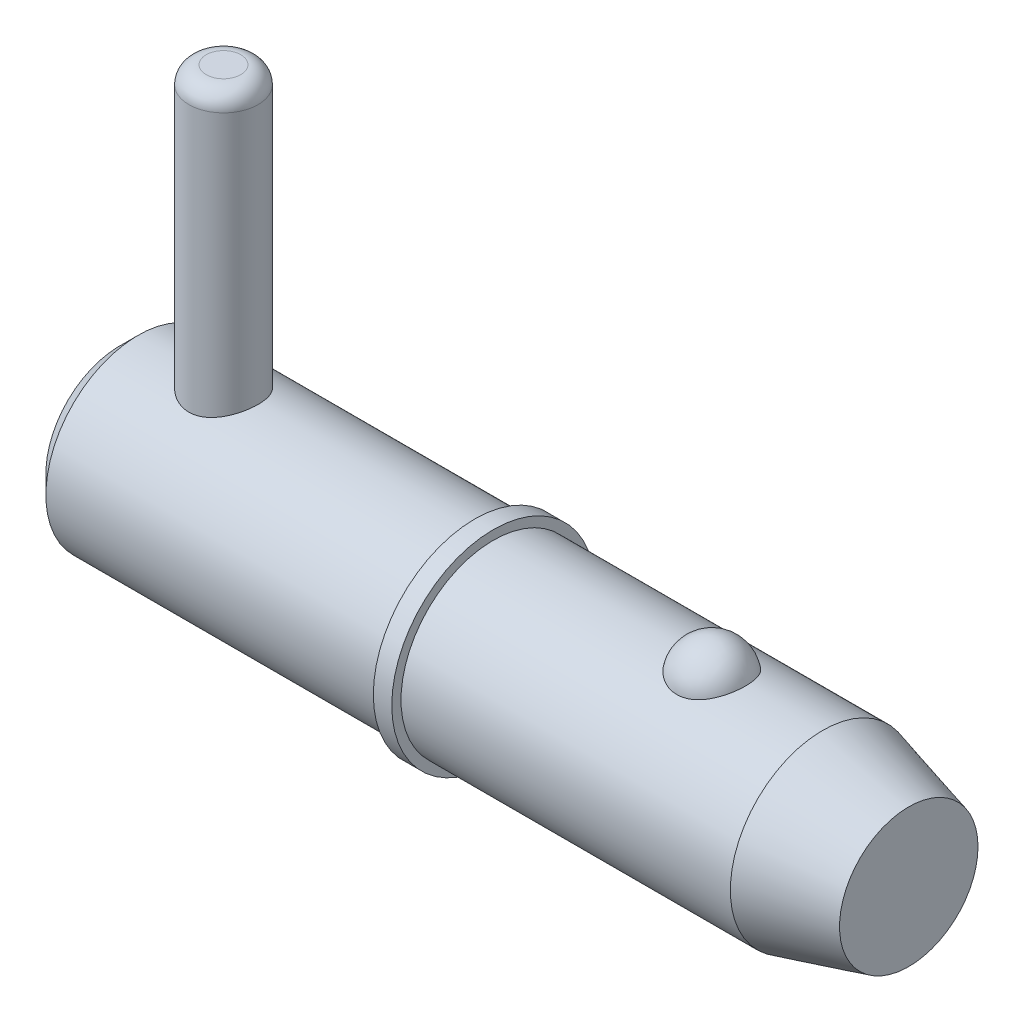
ISO-10303-21;
HEADER;
FILE_DESCRIPTION(('STEP AP214'),'2;1');
FILE_NAME('part.step','',(''),(''),'','','');
FILE_SCHEMA(('AUTOMOTIVE_DESIGN { 1 0 10303 214 1 1 1 1 }'));
ENDSEC;
DATA;
#1=APPLICATION_CONTEXT('core data for automotive mechanical design processes');
#2=APPLICATION_PROTOCOL_DEFINITION('international standard','automotive_design',2000,#1);
#3=PRODUCT_CONTEXT('',#1,'mechanical');
#4=PRODUCT('Part','Part','',(#3));
#5=PRODUCT_RELATED_PRODUCT_CATEGORY('part','',(#4));
#6=PRODUCT_DEFINITION_FORMATION('','',#4);
#7=PRODUCT_DEFINITION_CONTEXT('part definition',#1,'design');
#8=PRODUCT_DEFINITION('design','',#6,#7);
#9=PRODUCT_DEFINITION_SHAPE('','',#8);
#10=(LENGTH_UNIT() NAMED_UNIT(*) SI_UNIT(.MILLI.,.METRE.));
#11=(NAMED_UNIT(*) PLANE_ANGLE_UNIT() SI_UNIT($,.RADIAN.));
#12=(NAMED_UNIT(*) SI_UNIT($,.STERADIAN.) SOLID_ANGLE_UNIT());
#13=UNCERTAINTY_MEASURE_WITH_UNIT(LENGTH_MEASURE(1.E-05),#10,'distance_accuracy_value','');
#14=(GEOMETRIC_REPRESENTATION_CONTEXT(3) GLOBAL_UNCERTAINTY_ASSIGNED_CONTEXT((#13)) GLOBAL_UNIT_ASSIGNED_CONTEXT((#10,
#11,#12)) REPRESENTATION_CONTEXT('',''));
#15=CARTESIAN_POINT('',(0.,0.,0.));
#16=DIRECTION('',(0.,0.,1.));
#17=DIRECTION('',(1.,0.,0.));
#18=AXIS2_PLACEMENT_3D('',#15,#16,#17);
#19=CARTESIAN_POINT('',(7.14,25.4,0.));
#20=DIRECTION('',(0.,-1.,0.));
#21=DIRECTION('',(0.,0.,-1.));
#22=AXIS2_PLACEMENT_3D('',#19,#20,#21);
#23=CYLINDRICAL_SURFACE('',#22,2.38);
#24=CARTESIAN_POINT('',(7.14,-5.16,0.));
#25=DIRECTION('',(0.,1.,0.));
#26=DIRECTION('',(0.,0.,1.));
#27=AXIS2_PLACEMENT_3D('',#24,#25,#26);
#28=CIRCLE('',#27,2.38);
#29=CARTESIAN_POINT('',(7.14,-5.16,2.38));
#30=VERTEX_POINT('',#29);
#31=EDGE_CURVE('P0_E25',#30,#30,#28,.T.);
#32=ORIENTED_EDGE('',*,*,#31,.T.);
#33=EDGE_LOOP('',(#32));
#34=FACE_BOUND('',#33,.T.);
#35=CARTESIAN_POINT('',(7.14,24.21,0.));
#36=DIRECTION('',(0.,1.,0.));
#37=DIRECTION('',(0.,0.,1.));
#38=AXIS2_PLACEMENT_3D('',#35,#36,#37);
#39=CIRCLE('',#38,2.38);
#40=CARTESIAN_POINT('',(7.14,24.21,2.38));
#41=VERTEX_POINT('',#40);
#42=EDGE_CURVE('P0_E29',#41,#41,#39,.F.);
#43=ORIENTED_EDGE('',*,*,#42,.T.);
#44=EDGE_LOOP('',(#43));
#45=FACE_BOUND('',#44,.T.);
#46=ADVANCED_FACE('P0_F14',(#34,#45),#23,.T.);
#47=CARTESIAN_POINT('',(7.14,25.4,0.));
#48=DIRECTION('',(0.,1.,0.));
#49=DIRECTION('',(0.,0.,1.));
#50=AXIS2_PLACEMENT_3D('',#47,#48,#49);
#51=PLANE('',#50);
#52=CARTESIAN_POINT('',(7.14,25.4,0.));
#53=DIRECTION('',(0.,1.,0.));
#54=DIRECTION('',(0.,0.,1.));
#55=AXIS2_PLACEMENT_3D('',#52,#53,#54);
#56=CIRCLE('',#55,1.19);
#57=CARTESIAN_POINT('',(7.14,25.4,1.19));
#58=VERTEX_POINT('',#57);
#59=EDGE_CURVE('P0_E10',#58,#58,#56,.T.);
#60=ORIENTED_EDGE('',*,*,#59,.T.);
#61=EDGE_LOOP('',(#60));
#62=FACE_BOUND('',#61,.T.);
#63=ADVANCED_FACE('P0_F46',(#62),#51,.T.);
#64=CARTESIAN_POINT('',(7.14,-6.35,0.));
#65=DIRECTION('',(0.,1.,0.));
#66=DIRECTION('',(0.,0.,1.));
#67=AXIS2_PLACEMENT_3D('',#64,#65,#66);
#68=PLANE('',#67);
#69=CARTESIAN_POINT('',(7.14,-6.35,0.));
#70=DIRECTION('',(0.,1.,0.));
#71=DIRECTION('',(0.,0.,1.));
#72=AXIS2_PLACEMENT_3D('',#69,#70,#71);
#73=CIRCLE('',#72,1.19);
#74=CARTESIAN_POINT('',(7.14,-6.35,1.19));
#75=VERTEX_POINT('',#74);
#76=EDGE_CURVE('P0_E21',#75,#75,#73,.F.);
#77=ORIENTED_EDGE('',*,*,#76,.T.);
#78=EDGE_LOOP('',(#77));
#79=FACE_BOUND('',#78,.T.);
#80=ADVANCED_FACE('P0_F43',(#79),#68,.F.);
#81=CARTESIAN_POINT('',(7.14,-5.16,0.));
#82=DIRECTION('',(0.,1.,0.));
#83=DIRECTION('',(0.,0.,1.));
#84=AXIS2_PLACEMENT_3D('',#81,#82,#83);
#85=DEGENERATE_TOROIDAL_SURFACE('',#84,1.19,1.19,.T.);
#86=ORIENTED_EDGE('',*,*,#76,.F.);
#87=EDGE_LOOP('',(#86));
#88=FACE_BOUND('',#87,.T.);
#89=ORIENTED_EDGE('',*,*,#31,.F.);
#90=EDGE_LOOP('',(#89));
#91=FACE_BOUND('',#90,.T.);
#92=ADVANCED_FACE('P0_F38',(#88,#91),#85,.T.);
#93=CARTESIAN_POINT('',(7.14,24.21,0.));
#94=DIRECTION('',(0.,1.,0.));
#95=DIRECTION('',(0.,0.,1.));
#96=AXIS2_PLACEMENT_3D('',#93,#94,#95);
#97=DEGENERATE_TOROIDAL_SURFACE('',#96,1.19,1.19,.T.);
#98=ORIENTED_EDGE('',*,*,#42,.F.);
#99=EDGE_LOOP('',(#98));
#100=FACE_BOUND('',#99,.T.);
#101=ORIENTED_EDGE('',*,*,#59,.F.);
#102=EDGE_LOOP('',(#101));
#103=FACE_BOUND('',#102,.T.);
#104=ADVANCED_FACE('P0_F16',(#100,#103),#97,.T.);
#105=CLOSED_SHELL('',(#46,#63,#80,#92,#104));
#106=MANIFOLD_SOLID_BREP('P0_B1',#105);
#107=CARTESIAN_POINT('',(0.,0.,0.));
#108=DIRECTION('',(1.,0.,0.));
#109=DIRECTION('',(0.,0.,-1.));
#110=AXIS2_PLACEMENT_3D('',#107,#108,#109);
#111=CYLINDRICAL_SURFACE('',#110,6.35);
#112=CARTESIAN_POINT('',(48.3553693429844,0.,0.));
#113=DIRECTION('',(1.,0.,0.));
#114=DIRECTION('',(0.,0.,-1.));
#115=AXIS2_PLACEMENT_3D('',#112,#113,#114);
#116=CIRCLE('',#115,6.35);
#117=CARTESIAN_POINT('',(48.3553693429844,0.,-6.35));
#118=VERTEX_POINT('',#117);
#119=EDGE_CURVE('P1_E81',#118,#118,#116,.T.);
#120=ORIENTED_EDGE('',*,*,#119,.F.);
#121=EDGE_LOOP('',(#120));
#122=FACE_BOUND('',#121,.T.);
#123=CARTESIAN_POINT('',(25.7,0.,0.));
#124=DIRECTION('',(1.,0.,0.));
#125=DIRECTION('',(0.,0.,-1.));
#126=AXIS2_PLACEMENT_3D('',#123,#124,#125);
#127=CIRCLE('',#126,6.35);
#128=CARTESIAN_POINT('',(25.7,0.,-6.35));
#129=VERTEX_POINT('',#128);
#130=EDGE_CURVE('P1_E85',#129,#129,#127,.T.);
#131=ORIENTED_EDGE('',*,*,#130,.T.);
#132=EDGE_LOOP('',(#131));
#133=FACE_BOUND('',#132,.T.);
#134=CARTESIAN_POINT('',(40.7300214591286,5.87502187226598,2.40969251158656));
#135=CARTESIAN_POINT('',(40.6050305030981,5.87501645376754,2.40969773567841));
#136=CARTESIAN_POINT('',(40.4800806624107,5.87916061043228,2.39967292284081));
#137=CARTESIAN_POINT('',(40.2339091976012,5.89523112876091,2.35991730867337));
#138=CARTESIAN_POINT('',(40.1126863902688,5.90715499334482,2.33019283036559));
#139=CARTESIAN_POINT('',(39.8775170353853,5.9373956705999,2.25201402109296));
#140=CARTESIAN_POINT('',(39.7635602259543,5.95570321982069,2.20358681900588));
#141=CARTESIAN_POINT('',(39.54557352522,5.99672067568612,2.08937987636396));
#142=CARTESIAN_POINT('',(39.4415457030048,6.01943149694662,2.02359652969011));
#143=CARTESIAN_POINT('',(39.2429437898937,6.06760647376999,1.87428969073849));
#144=CARTESIAN_POINT('',(39.1487268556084,6.09313095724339,1.79031110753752));
#145=CARTESIAN_POINT('',(38.9752557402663,6.14375873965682,1.60800178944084));
#146=CARTESIAN_POINT('',(38.8960043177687,6.16886196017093,1.50966841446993));
#147=CARTESIAN_POINT('',(38.7508457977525,6.2172460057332,1.29645884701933));
#148=CARTESIAN_POINT('',(38.6856885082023,6.24039621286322,1.18104158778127));
#149=CARTESIAN_POINT('',(38.5747035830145,6.28117277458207,0.940351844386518));
#150=CARTESIAN_POINT('',(38.5288776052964,6.29879865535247,0.815078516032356));
#151=CARTESIAN_POINT('',(38.4570234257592,6.32692073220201,0.556494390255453));
#152=CARTESIAN_POINT('',(38.431249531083,6.33732517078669,0.423102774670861));
#153=CARTESIAN_POINT('',(38.4009885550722,6.34957673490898,0.153542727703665));
#154=CARTESIAN_POINT('',(38.3965009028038,6.35142408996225,0.0173743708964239));
#155=CARTESIAN_POINT('',(38.4088655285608,6.34638925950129,-0.253036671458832));
#156=CARTESIAN_POINT('',(38.4255949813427,6.33955731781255,-0.387285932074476));
#157=CARTESIAN_POINT('',(38.4798438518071,6.31794129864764,-0.650851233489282));
#158=CARTESIAN_POINT('',(38.5173636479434,6.30315707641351,-0.780167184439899));
#159=CARTESIAN_POINT('',(38.612500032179,6.26711642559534,-1.03041949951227));
#160=CARTESIAN_POINT('',(38.670143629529,6.24585130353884,-1.1513443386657));
#161=CARTESIAN_POINT('',(38.8043522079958,6.19905619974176,-1.38129800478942));
#162=CARTESIAN_POINT('',(38.8809187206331,6.17352587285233,-1.49032586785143));
#163=CARTESIAN_POINT('',(39.051753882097,6.12080227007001,-1.69393164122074));
#164=CARTESIAN_POINT('',(39.1461008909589,6.09360200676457,-1.78844209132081));
#165=CARTESIAN_POINT('',(39.3501196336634,6.0407043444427,-1.95970536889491));
#166=CARTESIAN_POINT('',(39.4597900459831,6.01500681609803,-2.03645972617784));
#167=CARTESIAN_POINT('',(39.6891876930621,5.96867714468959,-2.16845644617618));
#168=CARTESIAN_POINT('',(39.8086522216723,5.94794910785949,-2.22412062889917));
#169=CARTESIAN_POINT('',(40.0562188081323,5.91340580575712,-2.31440992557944));
#170=CARTESIAN_POINT('',(40.1843175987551,5.89958794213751,-2.34904294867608));
#171=CARTESIAN_POINT('',(40.438582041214,5.88111049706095,-2.39491590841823));
#172=CARTESIAN_POINT('',(40.5645207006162,5.876025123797,-2.40724512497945));
#173=CARTESIAN_POINT('',(40.8167867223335,5.87428980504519,-2.41147867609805));
#174=CARTESIAN_POINT('',(40.943114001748,5.87763817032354,-2.40338710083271));
#175=CARTESIAN_POINT('',(41.1884170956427,5.89212921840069,-2.36762715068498));
#176=CARTESIAN_POINT('',(41.3074992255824,5.90302431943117,-2.34058030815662));
#177=CARTESIAN_POINT('',(41.5392447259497,5.93113752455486,-2.26839066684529));
#178=CARTESIAN_POINT('',(41.6519075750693,5.94835614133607,-2.22324640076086));
#179=CARTESIAN_POINT('',(41.8704009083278,5.98773016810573,-2.11493806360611));
#180=CARTESIAN_POINT('',(41.976028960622,6.00998499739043,-2.05140269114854));
#181=CARTESIAN_POINT('',(42.1753006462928,6.0569014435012,-1.90842705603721));
#182=CARTESIAN_POINT('',(42.2689415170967,6.08156361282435,-1.82898313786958));
#183=CARTESIAN_POINT('',(42.4466754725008,6.13211715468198,-1.65182429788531));
#184=CARTESIAN_POINT('',(42.530055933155,6.15800825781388,-1.55339381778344));
#185=CARTESIAN_POINT('',(42.6797900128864,6.20712834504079,-1.34374214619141));
#186=CARTESIAN_POINT('',(42.7461405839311,6.23035685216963,-1.23251867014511));
#187=CARTESIAN_POINT('',(42.8623455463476,6.27251177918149,-0.996447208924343));
#188=CARTESIAN_POINT('',(42.9116072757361,6.29127762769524,-0.871278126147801));
#189=CARTESIAN_POINT('',(42.9896142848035,6.3215862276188,-0.613870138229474));
#190=CARTESIAN_POINT('',(43.0183593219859,6.33312889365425,-0.481631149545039));
#191=CARTESIAN_POINT('',(43.0547705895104,6.34782349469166,-0.213672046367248));
#192=CARTESIAN_POINT('',(43.0624134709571,6.35096613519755,-0.0779482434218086));
#193=CARTESIAN_POINT('',(43.0563951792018,6.34851322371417,0.192943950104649));
#194=CARTESIAN_POINT('',(43.0427343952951,6.3429178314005,0.328112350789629));
#195=CARTESIAN_POINT('',(42.9945036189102,6.32360512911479,0.593406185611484));
#196=CARTESIAN_POINT('',(42.9600313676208,6.30992579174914,0.723552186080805));
#197=CARTESIAN_POINT('',(42.8709539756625,6.27586325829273,0.975834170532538));
#198=CARTESIAN_POINT('',(42.8163476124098,6.25547965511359,1.09796966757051));
#199=CARTESIAN_POINT('',(42.6877587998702,6.20998183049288,1.33148921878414));
#200=CARTESIAN_POINT('',(42.6136742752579,6.18484288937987,1.44281227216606));
#201=CARTESIAN_POINT('',(42.4478204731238,6.13258735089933,1.65087683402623));
#202=CARTESIAN_POINT('',(42.3560515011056,6.10547078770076,1.74761859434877));
#203=CARTESIAN_POINT('',(42.1571839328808,6.05235879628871,1.92350926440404));
#204=CARTESIAN_POINT('',(42.050133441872,6.02636017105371,2.00271146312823));
#205=CARTESIAN_POINT('',(41.8231384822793,5.97843747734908,2.14154159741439));
#206=CARTESIAN_POINT('',(41.703191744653,5.95651412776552,2.2011660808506));
#207=CARTESIAN_POINT('',(41.4445236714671,5.91812106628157,2.30250570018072));
#208=CARTESIAN_POINT('',(41.3050698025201,5.90217533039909,2.34256795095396));
#209=CARTESIAN_POINT('',(41.0203974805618,5.88063128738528,2.39615214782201));
#210=CARTESIAN_POINT('',(40.8751817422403,5.87502816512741,2.40968644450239));
#211=CARTESIAN_POINT('',(40.7300214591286,5.87502187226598,2.40969251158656));
#212=B_SPLINE_CURVE_WITH_KNOTS('',3,(#134,#135,#136,#137,#138,#139,#140,#141,#142,#143,#144,
#145,#146,#147,#148,#149,#150,#151,#152,#153,#154,#155,#156,#157,#158,#159,#160,#161,#162,#163,
#164,#165,#166,#167,#168,#169,#170,#171,#172,#173,#174,#175,#176,#177,#178,#179,#180,#181,#182,
#183,#184,#185,#186,#187,#188,#189,#190,#191,#192,#193,#194,#195,#196,#197,#198,#199,#200,#201,
#202,#203,#204,#205,#206,#207,#208,#209,#210,#211),.UNSPECIFIED.,.T.,.F.,(4,2,2,2,2,2,2,2,2,2,2,
2,2,2,2,2,2,2,2,2,2,2,2,2,2,2,2,2,2,2,2,2,2,2,2,2,2,2,4),(0.,0.374440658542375,
0.748761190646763,1.12254078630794,1.49639810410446,1.88098871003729,2.26565013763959,
2.66741104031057,3.0692063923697,3.47601794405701,3.88281858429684,4.28727498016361,
4.69173873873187,5.09674745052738,5.50178895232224,5.90865911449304,6.31549420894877,
6.71369855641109,7.11175305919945,7.48978077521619,7.86773278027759,8.23383886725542,
8.59997464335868,8.97409044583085,9.34829231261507,9.7412266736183,10.1342313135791,
10.539752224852,10.945277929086,11.3512521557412,11.7572189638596,12.1612938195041,
12.5653932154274,12.9716540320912,13.37790783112,13.782909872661,14.1879832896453,
14.6230486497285,15.0579114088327),.UNSPECIFIED.);
#213=CARTESIAN_POINT('',(40.7300214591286,5.87502187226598,2.40969251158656));
#214=VERTEX_POINT('',#213);
#215=EDGE_CURVE('P1_E35',#214,#214,#212,.T.);
#216=ORIENTED_EDGE('',*,*,#215,.T.);
#217=EDGE_LOOP('',(#216));
#218=FACE_BOUND('',#217,.T.);
#219=ADVANCED_FACE('P1_F13',(#122,#133,#218),#111,.T.);
#220=CARTESIAN_POINT('',(0.,0.,0.));
#221=DIRECTION('',(-1.,0.,0.));
#222=DIRECTION('',(0.,0.,1.));
#223=AXIS2_PLACEMENT_3D('',#220,#221,#222);
#224=PLANE('',#223);
#225=CARTESIAN_POINT('',(0.,0.,0.));
#226=DIRECTION('',(1.,0.,0.));
#227=DIRECTION('',(0.,0.,-1.));
#228=AXIS2_PLACEMENT_3D('',#225,#226,#227);
#229=CIRCLE('',#228,5.08);
#230=CARTESIAN_POINT('',(0.,0.,-5.08));
#231=VERTEX_POINT('',#230);
#232=EDGE_CURVE('P1_E9',#231,#231,#229,.T.);
#233=ORIENTED_EDGE('',*,*,#232,.F.);
#234=EDGE_LOOP('',(#233));
#235=FACE_BOUND('',#234,.T.);
#236=ADVANCED_FACE('P1_F15',(#235),#224,.T.);
#237=CARTESIAN_POINT('',(1.27,0.,0.));
#238=DIRECTION('',(1.,0.,0.));
#239=DIRECTION('',(0.,0.,-1.));
#240=AXIS2_PLACEMENT_3D('',#237,#238,#239);
#241=CONICAL_SURFACE('',#240,6.35,0.78539816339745);
#242=ORIENTED_EDGE('',*,*,#232,.T.);
#243=EDGE_LOOP('',(#242));
#244=FACE_BOUND('',#243,.T.);
#245=CARTESIAN_POINT('',(1.27,0.,0.));
#246=DIRECTION('',(1.,0.,0.));
#247=DIRECTION('',(0.,0.,-1.));
#248=AXIS2_PLACEMENT_3D('',#245,#246,#247);
#249=CIRCLE('',#248,6.35);
#250=CARTESIAN_POINT('',(1.27,0.,-6.35));
#251=VERTEX_POINT('',#250);
#252=EDGE_CURVE('P1_E26',#251,#251,#249,.T.);
#253=ORIENTED_EDGE('',*,*,#252,.F.);
#254=EDGE_LOOP('',(#253));
#255=FACE_BOUND('',#254,.T.);
#256=ADVANCED_FACE('P1_F77',(#244,#255),#241,.T.);
#257=CARTESIAN_POINT('',(0.,0.,0.));
#258=DIRECTION('',(1.,0.,0.));
#259=DIRECTION('',(0.,0.,-1.));
#260=AXIS2_PLACEMENT_3D('',#257,#258,#259);
#261=CYLINDRICAL_SURFACE('',#260,6.35);
#262=CARTESIAN_POINT('',(7.14,-5.88711304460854,2.38));
#263=CARTESIAN_POINT('',(7.01146258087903,-5.88710856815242,2.38000480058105));
#264=CARTESIAN_POINT('',(6.88295682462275,-5.89136840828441,2.36955244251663));
#265=CARTESIAN_POINT('',(6.62981934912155,-5.90782785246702,2.32820953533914));
#266=CARTESIAN_POINT('',(6.50518751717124,-5.92002722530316,2.29731958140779));
#267=CARTESIAN_POINT('',(6.26352403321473,-5.95079384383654,2.21639366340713));
#268=CARTESIAN_POINT('',(6.14647496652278,-5.96934583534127,2.16640353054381));
#269=CARTESIAN_POINT('',(5.92237941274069,-6.01070278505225,2.04885862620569));
#270=CARTESIAN_POINT('',(5.81533593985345,-6.03350901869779,1.98129858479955));
#271=CARTESIAN_POINT('',(5.60897525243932,-6.08207341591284,1.82693902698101));
#272=CARTESIAN_POINT('',(5.51022503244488,-6.10791836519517,1.73940861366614));
#273=CARTESIAN_POINT('',(5.32840561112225,-6.15892405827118,1.54914379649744));
#274=CARTESIAN_POINT('',(5.24533975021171,-6.1840846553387,1.44640616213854));
#275=CARTESIAN_POINT('',(5.09451639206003,-6.23191821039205,1.22434014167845));
#276=CARTESIAN_POINT('',(5.02737511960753,-6.25447755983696,1.10456656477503));
#277=CARTESIAN_POINT('',(4.91443001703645,-6.2935236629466,0.854429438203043));
#278=CARTESIAN_POINT('',(4.86861879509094,-6.31001251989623,0.724069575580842));
#279=CARTESIAN_POINT('',(4.80162253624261,-6.33444370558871,0.46242122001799));
#280=CARTESIAN_POINT('',(4.77946137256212,-6.34272370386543,0.331414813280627));
#281=CARTESIAN_POINT('',(4.75726677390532,-6.35101600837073,0.0672982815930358));
#282=CARTESIAN_POINT('',(4.75722615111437,-6.35103100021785,-0.0658111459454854));
#283=CARTESIAN_POINT('',(4.77870510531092,-6.3430064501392,-0.323358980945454));
#284=CARTESIAN_POINT('',(4.79915922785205,-6.33536494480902,-0.447900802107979));
#285=CARTESIAN_POINT('',(4.85925493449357,-6.31340794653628,-0.69163609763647));
#286=CARTESIAN_POINT('',(4.89889787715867,-6.29909198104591,-0.810829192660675));
#287=CARTESIAN_POINT('',(4.9967414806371,-6.26494471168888,-1.04254212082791));
#288=CARTESIAN_POINT('',(5.05520370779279,-6.24503620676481,-1.1549396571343));
#289=CARTESIAN_POINT('',(5.1887948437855,-6.20171869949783,-1.3686079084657));
#290=CARTESIAN_POINT('',(5.26392912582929,-6.17830856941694,-1.46987502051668));
#291=CARTESIAN_POINT('',(5.43386591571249,-6.12878580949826,-1.66468415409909));
#292=CARTESIAN_POINT('',(5.52956139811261,-6.10259519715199,-1.75742857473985));
#293=CARTESIAN_POINT('',(5.73530435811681,-6.05155777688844,-1.92585331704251));
#294=CARTESIAN_POINT('',(5.84535542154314,-6.02671130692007,-2.00152936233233));
#295=CARTESIAN_POINT('',(6.07982989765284,-5.98068420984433,-2.13519109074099));
#296=CARTESIAN_POINT('',(6.20451768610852,-5.95959698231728,-2.19274775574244));
#297=CARTESIAN_POINT('',(6.4628145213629,-5.92455622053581,-2.28574558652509));
#298=CARTESIAN_POINT('',(6.59641856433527,-5.91059872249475,-2.32119904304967));
#299=CARTESIAN_POINT('',(6.86087441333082,-5.8923327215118,-2.36717069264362));
#300=CARTESIAN_POINT('',(6.99147192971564,-5.8875347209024,-2.37895573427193));
#301=CARTESIAN_POINT('',(7.25283805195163,-5.88674545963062,-2.38091046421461));
#302=CARTESIAN_POINT('',(7.38360660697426,-5.89075200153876,-2.37108554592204));
#303=CARTESIAN_POINT('',(7.63510696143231,-5.90662331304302,-2.33124781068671));
#304=CARTESIAN_POINT('',(7.75602069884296,-5.91810660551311,-2.30221396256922));
#305=CARTESIAN_POINT('',(7.99120505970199,-5.94718527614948,-2.22601401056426));
#306=CARTESIAN_POINT('',(8.10547431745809,-5.96478190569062,-2.17884419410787));
#307=CARTESIAN_POINT('',(8.32888632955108,-6.00491533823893,-2.06572311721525));
#308=CARTESIAN_POINT('',(8.43767672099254,-6.02761250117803,-1.99913452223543));
#309=CARTESIAN_POINT('',(8.6429894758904,-6.07511988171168,-1.84974438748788));
#310=CARTESIAN_POINT('',(8.73950733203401,-6.09993087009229,-1.76693691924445));
#311=CARTESIAN_POINT('',(8.9238741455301,-6.1507686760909,-1.58125563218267));
#312=CARTESIAN_POINT('',(9.01078732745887,-6.17677301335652,-1.47744327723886));
#313=CARTESIAN_POINT('',(9.16607127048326,-6.22556172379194,-1.25606967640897));
#314=CARTESIAN_POINT('',(9.23444197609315,-6.24834608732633,-1.13850838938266));
#315=CARTESIAN_POINT('',(9.3502493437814,-6.28811144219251,-0.893050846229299));
#316=CARTESIAN_POINT('',(9.39775808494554,-6.30511236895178,-0.765192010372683));
#317=CARTESIAN_POINT('',(9.47032640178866,-6.33145833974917,-0.502514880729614));
#318=CARTESIAN_POINT('',(9.49539651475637,-6.34080697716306,-0.367699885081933));
#319=CARTESIAN_POINT('',(9.52124059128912,-6.35045496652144,-0.103396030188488));
#320=CARTESIAN_POINT('',(9.52334421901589,-6.35124952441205,0.025945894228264));
#321=CARTESIAN_POINT('',(9.50661518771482,-6.34499064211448,0.283061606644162));
#322=CARTESIAN_POINT('',(9.48778504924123,-6.33793814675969,0.410835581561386));
#323=CARTESIAN_POINT('',(9.43065630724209,-6.31700307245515,0.658028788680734));
#324=CARTESIAN_POINT('',(9.39284291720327,-6.30329098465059,0.7775756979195));
#325=CARTESIAN_POINT('',(9.29930406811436,-6.27046903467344,1.00863789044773));
#326=CARTESIAN_POINT('',(9.2435752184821,-6.25135815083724,1.12015164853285));
#327=CARTESIAN_POINT('',(9.11312349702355,-6.20865254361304,1.33711407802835));
#328=CARTESIAN_POINT('',(9.03770094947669,-6.18490316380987,1.44211105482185));
#329=CARTESIAN_POINT('',(8.87110640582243,-6.13583718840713,1.63836897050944));
#330=CARTESIAN_POINT('',(8.77992879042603,-6.11052003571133,1.72962498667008));
#331=CARTESIAN_POINT('',(8.57869799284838,-6.05953829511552,1.90076098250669));
#332=CARTESIAN_POINT('',(8.46790320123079,-6.03392573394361,1.97978778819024));
#333=CARTESIAN_POINT('',(8.23379693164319,-5.98676607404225,2.11813466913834));
#334=CARTESIAN_POINT('',(8.11048418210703,-5.9652193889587,2.17745273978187));
#335=CARTESIAN_POINT('',(7.84900037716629,-5.92818393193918,2.27641807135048));
#336=CARTESIAN_POINT('',(7.71041678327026,-5.91299857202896,2.31510015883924));
#337=CARTESIAN_POINT('',(7.42787316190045,-5.89246887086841,2.36688002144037));
#338=CARTESIAN_POINT('',(7.28391673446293,-5.88711805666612,2.37999462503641));
#339=CARTESIAN_POINT('',(7.14,-5.88711304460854,2.38));
#340=B_SPLINE_CURVE_WITH_KNOTS('',3,(#262,#263,#264,#265,#266,#267,#268,#269,#270,#271,#272,
#273,#274,#275,#276,#277,#278,#279,#280,#281,#282,#283,#284,#285,#286,#287,#288,#289,#290,#291,
#292,#293,#294,#295,#296,#297,#298,#299,#300,#301,#302,#303,#304,#305,#306,#307,#308,#309,#310,
#311,#312,#313,#314,#315,#316,#317,#318,#319,#320,#321,#322,#323,#324,#325,#326,#327,#328,#329,
#330,#331,#332,#333,#334,#335,#336,#337,#338,#339),.UNSPECIFIED.,.T.,.F.,(4,2,2,2,2,2,2,2,2,2,2,
2,2,2,2,2,2,2,2,2,2,2,2,2,2,2,2,2,2,2,2,2,2,2,2,2,2,2,4),(0.,0.385076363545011,
0.770141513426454,1.15428843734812,1.53855071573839,1.94016118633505,2.3418570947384,
2.75720522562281,3.1724093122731,3.569721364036,3.96690431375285,4.34445758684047,
4.72203759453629,5.10511017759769,5.48830640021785,5.89390240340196,6.29959991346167,
6.71428455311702,7.12873839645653,7.52034494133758,7.91185376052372,8.28480528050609,
8.65783318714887,9.0448340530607,9.43197664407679,9.84363087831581,10.2552863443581,
10.6655081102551,11.0755371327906,11.4616919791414,11.847800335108,12.224507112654,
12.6012852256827,12.9938941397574,13.386643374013,13.8000944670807,14.2135876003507,
14.6450218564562,15.0761720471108),.UNSPECIFIED.);
#341=CARTESIAN_POINT('',(7.14,-5.88711304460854,2.38));
#342=VERTEX_POINT('',#341);
#343=EDGE_CURVE('P1_E17',#342,#342,#340,.T.);
#344=ORIENTED_EDGE('',*,*,#343,.F.);
#345=EDGE_LOOP('',(#344));
#346=FACE_BOUND('',#345,.T.);
#347=CARTESIAN_POINT('',(7.14,5.88711304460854,2.38));
#348=CARTESIAN_POINT('',(7.26853741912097,5.88710856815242,2.38000480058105));
#349=CARTESIAN_POINT('',(7.39704317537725,5.89136840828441,2.36955244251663));
#350=CARTESIAN_POINT('',(7.65018065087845,5.90782785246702,2.32820953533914));
#351=CARTESIAN_POINT('',(7.77481248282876,5.92002722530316,2.29731958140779));
#352=CARTESIAN_POINT('',(8.01647596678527,5.95079384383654,2.21639366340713));
#353=CARTESIAN_POINT('',(8.13352503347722,5.96934583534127,2.16640353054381));
#354=CARTESIAN_POINT('',(8.35762058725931,6.01070278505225,2.04885862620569));
#355=CARTESIAN_POINT('',(8.46466406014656,6.03350901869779,1.98129858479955));
#356=CARTESIAN_POINT('',(8.67102474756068,6.08207341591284,1.82693902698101));
#357=CARTESIAN_POINT('',(8.76977496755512,6.10791836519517,1.73940861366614));
#358=CARTESIAN_POINT('',(8.95159438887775,6.15892405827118,1.54914379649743));
#359=CARTESIAN_POINT('',(9.03466024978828,6.1840846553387,1.44640616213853));
#360=CARTESIAN_POINT('',(9.18548360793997,6.23191821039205,1.22434014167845));
#361=CARTESIAN_POINT('',(9.25262488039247,6.25447755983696,1.10456656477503));
#362=CARTESIAN_POINT('',(9.36556998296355,6.2935236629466,0.854429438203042));
#363=CARTESIAN_POINT('',(9.41138120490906,6.31001251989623,0.72406957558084));
#364=CARTESIAN_POINT('',(9.47837746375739,6.33444370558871,0.462421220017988));
#365=CARTESIAN_POINT('',(9.50053862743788,6.34272370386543,0.331414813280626));
#366=CARTESIAN_POINT('',(9.52273322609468,6.35101600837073,0.0672982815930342));
#367=CARTESIAN_POINT('',(9.52277384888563,6.35103100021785,-0.0658111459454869));
#368=CARTESIAN_POINT('',(9.50129489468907,6.3430064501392,-0.323358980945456));
#369=CARTESIAN_POINT('',(9.48084077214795,6.33536494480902,-0.447900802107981));
#370=CARTESIAN_POINT('',(9.42074506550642,6.31340794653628,-0.691636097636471));
#371=CARTESIAN_POINT('',(9.38110212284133,6.29909198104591,-0.810829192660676));
#372=CARTESIAN_POINT('',(9.2832585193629,6.26494471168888,-1.04254212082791));
#373=CARTESIAN_POINT('',(9.22479629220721,6.24503620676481,-1.1549396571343));
#374=CARTESIAN_POINT('',(9.0912051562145,6.20171869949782,-1.3686079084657));
#375=CARTESIAN_POINT('',(9.0160708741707,6.17830856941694,-1.46987502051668));
#376=CARTESIAN_POINT('',(8.84613408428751,6.12878580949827,-1.66468415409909));
#377=CARTESIAN_POINT('',(8.75043860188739,6.10259519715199,-1.75742857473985));
#378=CARTESIAN_POINT('',(8.54469564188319,6.05155777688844,-1.92585331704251));
#379=CARTESIAN_POINT('',(8.43464457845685,6.02671130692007,-2.00152936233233));
#380=CARTESIAN_POINT('',(8.20017010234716,5.98068420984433,-2.13519109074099));
#381=CARTESIAN_POINT('',(8.07548231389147,5.95959698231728,-2.19274775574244));
#382=CARTESIAN_POINT('',(7.8171854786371,5.9245562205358,-2.28574558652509));
#383=CARTESIAN_POINT('',(7.68358143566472,5.91059872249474,-2.32119904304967));
#384=CARTESIAN_POINT('',(7.41912558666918,5.8923327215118,-2.36717069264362));
#385=CARTESIAN_POINT('',(7.28852807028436,5.8875347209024,-2.37895573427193));
#386=CARTESIAN_POINT('',(7.02716194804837,5.88674545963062,-2.38091046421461));
#387=CARTESIAN_POINT('',(6.89639339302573,5.89075200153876,-2.37108554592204));
#388=CARTESIAN_POINT('',(6.64489303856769,5.90662331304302,-2.33124781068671));
#389=CARTESIAN_POINT('',(6.52397930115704,5.91810660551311,-2.30221396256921));
#390=CARTESIAN_POINT('',(6.288794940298,5.94718527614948,-2.22601401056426));
#391=CARTESIAN_POINT('',(6.17452568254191,5.96478190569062,-2.17884419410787));
#392=CARTESIAN_POINT('',(5.95111367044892,6.00491533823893,-2.06572311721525));
#393=CARTESIAN_POINT('',(5.84232327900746,6.02761250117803,-1.99913452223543));
#394=CARTESIAN_POINT('',(5.6370105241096,6.07511988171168,-1.84974438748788));
#395=CARTESIAN_POINT('',(5.54049266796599,6.09993087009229,-1.76693691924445));
#396=CARTESIAN_POINT('',(5.3561258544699,6.1507686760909,-1.58125563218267));
#397=CARTESIAN_POINT('',(5.26921267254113,6.17677301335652,-1.47744327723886));
#398=CARTESIAN_POINT('',(5.11392872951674,6.22556172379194,-1.25606967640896));
#399=CARTESIAN_POINT('',(5.04555802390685,6.24834608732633,-1.13850838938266));
#400=CARTESIAN_POINT('',(4.9297506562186,6.28811144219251,-0.893050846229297));
#401=CARTESIAN_POINT('',(4.88224191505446,6.30511236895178,-0.76519201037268));
#402=CARTESIAN_POINT('',(4.80967359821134,6.33145833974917,-0.502514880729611));
#403=CARTESIAN_POINT('',(4.78460348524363,6.34080697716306,-0.36769988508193));
#404=CARTESIAN_POINT('',(4.75875940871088,6.35045496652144,-0.103396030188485));
#405=CARTESIAN_POINT('',(4.75665578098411,6.35124952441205,0.025945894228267));
#406=CARTESIAN_POINT('',(4.77338481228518,6.34499064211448,0.283061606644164));
#407=CARTESIAN_POINT('',(4.79221495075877,6.33793814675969,0.410835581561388));
#408=CARTESIAN_POINT('',(4.84934369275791,6.31700307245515,0.658028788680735));
#409=CARTESIAN_POINT('',(4.88715708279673,6.30329098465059,0.777575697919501));
#410=CARTESIAN_POINT('',(4.98069593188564,6.27046903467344,1.00863789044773));
#411=CARTESIAN_POINT('',(5.0364247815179,6.25135815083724,1.12015164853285));
#412=CARTESIAN_POINT('',(5.16687650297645,6.20865254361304,1.33711407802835));
#413=CARTESIAN_POINT('',(5.24229905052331,6.18490316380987,1.44211105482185));
#414=CARTESIAN_POINT('',(5.40889359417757,6.13583718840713,1.63836897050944));
#415=CARTESIAN_POINT('',(5.50007120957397,6.11052003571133,1.72962498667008));
#416=CARTESIAN_POINT('',(5.70130200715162,6.05953829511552,1.90076098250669));
#417=CARTESIAN_POINT('',(5.81209679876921,6.03392573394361,1.97978778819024));
#418=CARTESIAN_POINT('',(6.04620306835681,5.98676607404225,2.11813466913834));
#419=CARTESIAN_POINT('',(6.16951581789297,5.9652193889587,2.17745273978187));
#420=CARTESIAN_POINT('',(6.43099962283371,5.92818393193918,2.27641807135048));
#421=CARTESIAN_POINT('',(6.56958321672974,5.91299857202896,2.31510015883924));
#422=CARTESIAN_POINT('',(6.85212683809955,5.89246887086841,2.36688002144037));
#423=CARTESIAN_POINT('',(6.99608326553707,5.88711805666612,2.37999462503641));
#424=CARTESIAN_POINT('',(7.14,5.88711304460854,2.38));
#425=B_SPLINE_CURVE_WITH_KNOTS('',3,(#347,#348,#349,#350,#351,#352,#353,#354,#355,#356,#357,
#358,#359,#360,#361,#362,#363,#364,#365,#366,#367,#368,#369,#370,#371,#372,#373,#374,#375,#376,
#377,#378,#379,#380,#381,#382,#383,#384,#385,#386,#387,#388,#389,#390,#391,#392,#393,#394,#395,
#396,#397,#398,#399,#400,#401,#402,#403,#404,#405,#406,#407,#408,#409,#410,#411,#412,#413,#414,
#415,#416,#417,#418,#419,#420,#421,#422,#423,#424),.UNSPECIFIED.,.T.,.F.,(4,2,2,2,2,2,2,2,2,2,2,
2,2,2,2,2,2,2,2,2,2,2,2,2,2,2,2,2,2,2,2,2,2,2,2,2,2,2,4),(0.,0.385076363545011,
0.770141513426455,1.15428843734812,1.53855071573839,1.94016118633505,2.3418570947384,
2.75720522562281,3.1724093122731,3.56972136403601,3.96690431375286,4.34445758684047,
4.72203759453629,5.10511017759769,5.48830640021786,5.89390240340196,6.29959991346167,
6.71428455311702,7.12873839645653,7.52034494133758,7.91185376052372,8.2848052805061,
8.65783318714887,9.0448340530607,9.43197664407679,9.84363087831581,10.2552863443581,
10.6655081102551,11.0755371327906,11.4616919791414,11.847800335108,12.2245071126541,
12.6012852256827,12.9938941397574,13.386643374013,13.8000944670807,14.2135876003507,
14.6450218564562,15.0761720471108),.UNSPECIFIED.);
#426=CARTESIAN_POINT('',(7.14,5.88711304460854,2.38));
#427=VERTEX_POINT('',#426);
#428=EDGE_CURVE('P1_E43',#427,#427,#425,.T.);
#429=ORIENTED_EDGE('',*,*,#428,.F.);
#430=EDGE_LOOP('',(#429));
#431=FACE_BOUND('',#430,.T.);
#432=ORIENTED_EDGE('',*,*,#252,.T.);
#433=EDGE_LOOP('',(#432));
#434=FACE_BOUND('',#433,.T.);
#435=CARTESIAN_POINT('',(24.43,0.,0.));
#436=DIRECTION('',(1.,0.,0.));
#437=DIRECTION('',(0.,0.,-1.));
#438=AXIS2_PLACEMENT_3D('',#435,#436,#437);
#439=CIRCLE('',#438,6.35);
#440=CARTESIAN_POINT('',(24.43,0.,-6.35));
#441=VERTEX_POINT('',#440);
#442=EDGE_CURVE('P1_E31',#441,#441,#439,.T.);
#443=ORIENTED_EDGE('',*,*,#442,.F.);
#444=EDGE_LOOP('',(#443));
#445=FACE_BOUND('',#444,.T.);
#446=ADVANCED_FACE('P1_F103',(#346,#431,#434,#445),#261,.T.);
#447=CARTESIAN_POINT('',(24.43,6.35,0.));
#448=DIRECTION('',(-1.,0.,0.));
#449=DIRECTION('',(0.,0.,1.));
#450=AXIS2_PLACEMENT_3D('',#447,#448,#449);
#451=PLANE('',#450);
#452=ORIENTED_EDGE('',*,*,#442,.T.);
#453=EDGE_LOOP('',(#452));
#454=FACE_BOUND('',#453,.T.);
#455=CARTESIAN_POINT('',(24.43,0.,0.));
#456=DIRECTION('',(1.,0.,0.));
#457=DIRECTION('',(0.,0.,-1.));
#458=AXIS2_PLACEMENT_3D('',#455,#456,#457);
#459=CIRCLE('',#458,6.985);
#460=CARTESIAN_POINT('',(24.43,0.,-6.985));
#461=VERTEX_POINT('',#460);
#462=EDGE_CURVE('P1_E91',#461,#461,#459,.T.);
#463=ORIENTED_EDGE('',*,*,#462,.F.);
#464=EDGE_LOOP('',(#463));
#465=FACE_BOUND('',#464,.T.);
#466=ADVANCED_FACE('P1_F100',(#454,#465),#451,.T.);
#467=CARTESIAN_POINT('',(0.,0.,0.));
#468=DIRECTION('',(1.,0.,0.));
#469=DIRECTION('',(0.,0.,-1.));
#470=AXIS2_PLACEMENT_3D('',#467,#468,#469);
#471=CYLINDRICAL_SURFACE('',#470,6.985);
#472=ORIENTED_EDGE('',*,*,#462,.T.);
#473=EDGE_LOOP('',(#472));
#474=FACE_BOUND('',#473,.T.);
#475=CARTESIAN_POINT('',(25.7,0.,0.));
#476=DIRECTION('',(1.,0.,0.));
#477=DIRECTION('',(0.,0.,-1.));
#478=AXIS2_PLACEMENT_3D('',#475,#476,#477);
#479=CIRCLE('',#478,6.985);
#480=CARTESIAN_POINT('',(25.7,0.,-6.985));
#481=VERTEX_POINT('',#480);
#482=EDGE_CURVE('P1_E88',#481,#481,#479,.T.);
#483=ORIENTED_EDGE('',*,*,#482,.F.);
#484=EDGE_LOOP('',(#483));
#485=FACE_BOUND('',#484,.T.);
#486=ADVANCED_FACE('P1_F68',(#474,#485),#471,.T.);
#487=CARTESIAN_POINT('',(25.7,6.985,0.));
#488=DIRECTION('',(1.,0.,0.));
#489=DIRECTION('',(0.,0.,-1.));
#490=AXIS2_PLACEMENT_3D('',#487,#488,#489);
#491=PLANE('',#490);
#492=ORIENTED_EDGE('',*,*,#482,.T.);
#493=EDGE_LOOP('',(#492));
#494=FACE_BOUND('',#493,.T.);
#495=ORIENTED_EDGE('',*,*,#130,.F.);
#496=EDGE_LOOP('',(#495));
#497=FACE_BOUND('',#496,.T.);
#498=ADVANCED_FACE('P1_F62',(#494,#497),#491,.T.);
#499=CARTESIAN_POINT('',(54.28,0.,0.));
#500=DIRECTION('',(-1.,0.,0.));
#501=DIRECTION('',(0.,0.,1.));
#502=AXIS2_PLACEMENT_3D('',#499,#500,#501);
#503=CONICAL_SURFACE('',#502,4.76250000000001,0.26179938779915);
#504=ORIENTED_EDGE('',*,*,#119,.T.);
#505=EDGE_LOOP('',(#504));
#506=FACE_BOUND('',#505,.T.);
#507=CARTESIAN_POINT('',(54.28,0.,0.));
#508=DIRECTION('',(1.,0.,0.));
#509=DIRECTION('',(0.,0.,-1.));
#510=AXIS2_PLACEMENT_3D('',#507,#508,#509);
#511=CIRCLE('',#510,4.76250000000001);
#512=CARTESIAN_POINT('',(54.28,0.,-4.76250000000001));
#513=VERTEX_POINT('',#512);
#514=EDGE_CURVE('P1_E42',#513,#513,#511,.T.);
#515=ORIENTED_EDGE('',*,*,#514,.F.);
#516=EDGE_LOOP('',(#515));
#517=FACE_BOUND('',#516,.T.);
#518=ADVANCED_FACE('P1_F59',(#506,#517),#503,.T.);
#519=CARTESIAN_POINT('',(54.28,4.76250000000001,0.));
#520=DIRECTION('',(1.,0.,0.));
#521=DIRECTION('',(0.,0.,-1.));
#522=AXIS2_PLACEMENT_3D('',#519,#520,#521);
#523=PLANE('',#522);
#524=ORIENTED_EDGE('',*,*,#514,.T.);
#525=EDGE_LOOP('',(#524));
#526=FACE_BOUND('',#525,.T.);
#527=ADVANCED_FACE('P1_F55',(#526),#523,.T.);
#528=CARTESIAN_POINT('',(40.7300214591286,5.715,0.));
#529=DIRECTION('',(-1.,0.,0.));
#530=DIRECTION('',(0.,1.,0.));
#531=AXIS2_PLACEMENT_3D('',#528,#529,#530);
#532=SPHERICAL_SURFACE('',#531,2.41499999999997);
#533=ORIENTED_EDGE('',*,*,#215,.F.);
#534=EDGE_LOOP('',(#533));
#535=FACE_BOUND('',#534,.T.);
#536=ADVANCED_FACE('P1_F50',(#535),#532,.T.);
#537=CARTESIAN_POINT('',(7.14,-6.985,0.));
#538=DIRECTION('',(0.,1.,0.));
#539=DIRECTION('',(0.,0.,1.));
#540=AXIS2_PLACEMENT_3D('',#537,#538,#539);
#541=CYLINDRICAL_SURFACE('',#540,2.38);
#542=ORIENTED_EDGE('',*,*,#343,.T.);
#543=EDGE_LOOP('',(#542));
#544=FACE_BOUND('',#543,.T.);
#545=ORIENTED_EDGE('',*,*,#428,.T.);
#546=EDGE_LOOP('',(#545));
#547=FACE_BOUND('',#546,.T.);
#548=ADVANCED_FACE('P1_F54',(#544,#547),#541,.F.);
#549=CLOSED_SHELL('',(#219,#236,#256,#446,#466,#486,#498,#518,#527,#536,#548));
#550=MANIFOLD_SOLID_BREP('P1_B1',#549);
#551=ADVANCED_BREP_SHAPE_REPRESENTATION('',(#18,#106,#550),#14);
#552=SHAPE_DEFINITION_REPRESENTATION(#9,#551);
ENDSEC;
END-ISO-10303-21;
